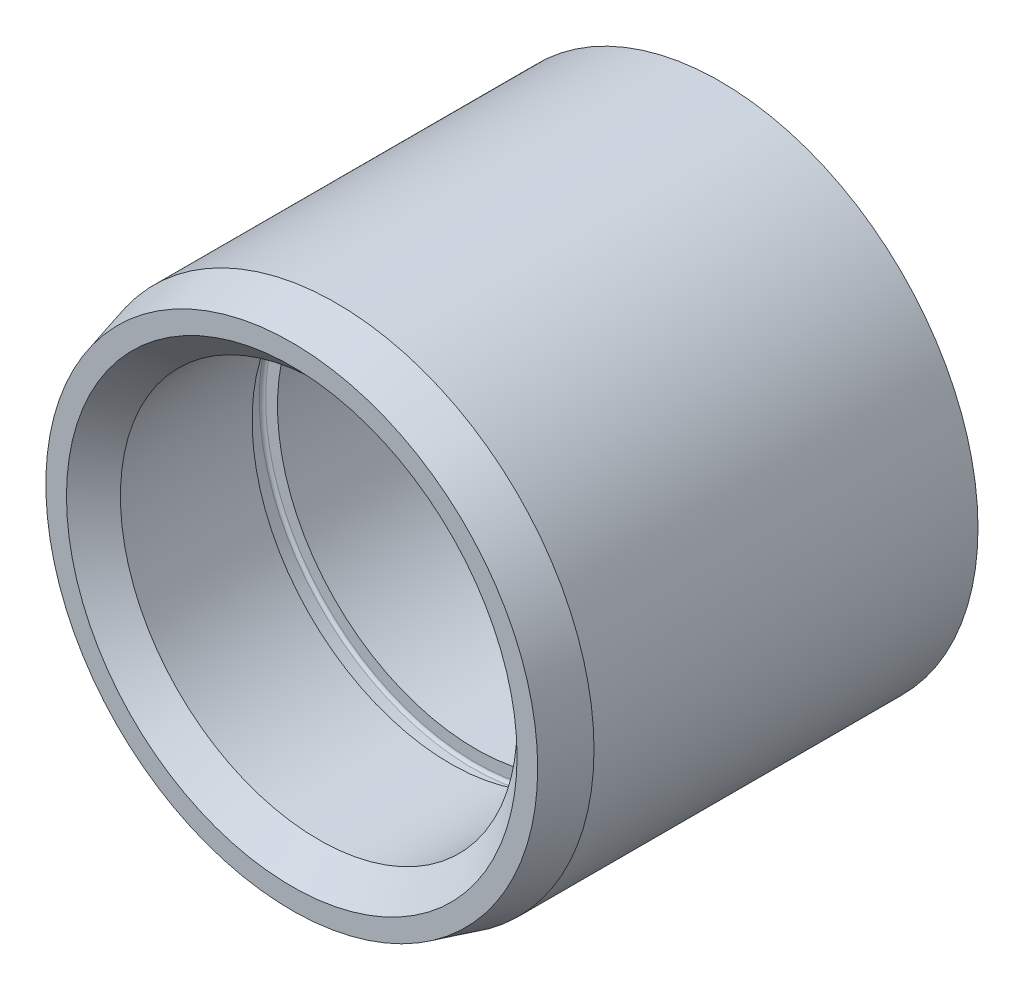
from build123d import *

# Parameters (mm, degrees)
TROU_TARAUD_M41_D     = 3.3
TROU_TARAUD_M41_DEPTH = 10
TROU_TARAUD_M41_TIP   = 0.991420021


with BuildPart() as part:
    # Esquisse2 → R_volution1 (revolve)
    with BuildSketch(Plane(origin=(0, 0, 0), x_dir=(0, 0, -1), z_dir=(1, 0, 0)), mode=Mode.PRIVATE) as r_volution1_sk:
        with BuildLine():
            Line((8.890868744, 32.5), (57.292792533, 32.5))
            Line((57.292792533, 32.5), (57.292792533, 25))
            Line((57.292792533, 25), (26.492792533, 25))
            Line((26.492792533, 25), (26.492792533, 26.5))
            ThreePointArc((26.492792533, 26.5), (26.375635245, 26.782842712), (26.092792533, 26.9))
            Line((26.092792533, 26.9), (23.692792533, 26.9))
            ThreePointArc((23.692792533, 26.9), (23.40994982, 26.782842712), (23.292792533, 26.5))
            Line((23.292792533, 26.5), (23.292792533, 25))
            Line((23.292792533, 25), (6.692792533, 25))
            Line((6.692792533, 25), (3.292792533, 28.4))
            Line((3.292792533, 28.4), (3.292792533, 31))
            Line((3.292792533, 31), (8.890868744, 32.5))
        make_face()
    revolve(r_volution1_sk.sketch.rotate(Axis((0, 0, 0), (0, 0, -1)), 90), axis=Axis((0, 0, 0), (0, 0, -1)))

    # Trou taraud_ M41
    with Locations(Plane(origin=(0, 28.75, -57.292792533), x_dir=(-1, 0, 0), z_dir=(0, 0, -1))):
        with Locations((0, 0), (0, -57.5)):
            Hole(TROU_TARAUD_M41_D / 2, depth=TROU_TARAUD_M41_DEPTH)
            with Locations((0, 0, -(TROU_TARAUD_M41_DEPTH + TROU_TARAUD_M41_TIP / 2))):  # 118° drill point
                Cone(0, TROU_TARAUD_M41_D / 2, TROU_TARAUD_M41_TIP, mode=Mode.SUBTRACT)


solid = part.part
